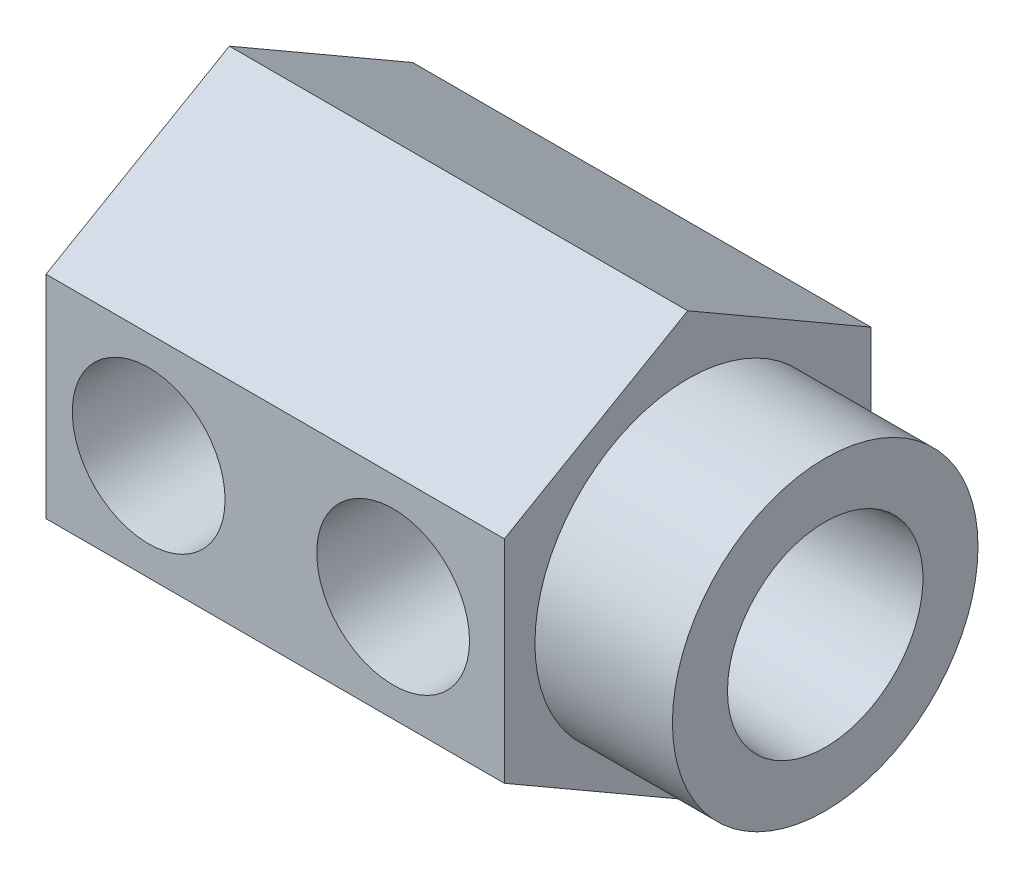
from build123d import *

# Parameters (mm, degrees)
BOSS_EXTRUDE1_DEPTH                = 23.8125
SKETCH2_R                          = 7.9375
BOSS_EXTRUDE2_DEPTH                = 7.14375
F_1_16_NPT_TAPPED_HOLE2_AT_2_COUNT = 2
F_1_16_NPT_TAPPED_HOLE2_AT_2_PITCH = 12.7
F_21_0_159_DIAMETER_HOLE1_D        = 4.0386
F_21_0_159_DIAMETER_HOLE1_DEPTH    = 25.4
F_21_0_159_DIAMETER_HOLE1_TIP      = 1.213317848
F_3_16_0_1875_DIAMETER_HOLE1_D     = 4.7625
F_3_16_0_1875_DIAMETER_HOLE1_DEPTH = 22.86
F_3_16_0_1875_DIAMETER_HOLE1_TIP   = 1.430799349


with BuildPart() as part:
    # Sketch1 → Boss-Extrude1 (new body)
    with BuildSketch(Plane(origin=(0, 0, 0), x_dir=(0, 0, -1), z_dir=(1, 0, 0))):
        Polygon((9.525, -5.499261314), (9.525, 5.499261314), (0, 10.998522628), (-9.525, 5.499261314), (-9.525, -5.499261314), (0, -10.998522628), align=None)
    extrude(amount=BOSS_EXTRUDE1_DEPTH)

    # Sketch2 → Boss-Extrude2 (add)
    with BuildSketch(Plane(origin=(23.8125, 0, 0), x_dir=(0, 0, -1), z_dir=(1, 0, 0))):
        Circle(SKETCH2_R)
    extrude(amount=BOSS_EXTRUDE2_DEPTH)

    # Sketch3 → Cut-Revolve1 (revolve, cut)
    with BuildSketch(Plane(origin=(0, 0, 0), x_dir=(1, 0, 0), z_dir=(0, 1, 0)), mode=Mode.PRIVATE) as cut_revolve1_sk:
        Polygon((30.95625, 0), (30.95625, 5.07746), (23.97125, 4.711391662), (23.97125, 3.4163), (14.31925, 3.4163), (14.31925, 0), align=None)
    revolve(cut_revolve1_sk.sketch.rotate(Axis((-5.616376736, 0, 0), (1, 0, 0)), 180), axis=Axis((-5.616376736, 0, 0), (1, 0, 0)), mode=Mode.SUBTRACT)

    # Sketch4 → 1_16 NPT Tapped Hole1 (revolve, cut)
    with BuildSketch(Plane(origin=(5.334, 0, -9.525), x_dir=(0, 1, 0), z_dir=(1, 0, 0))):
        Polygon((0, 0), (0, 13.436705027), (3.0734, 11.59002), (3.0734, 6.88594), (3.762575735, 6.88594), (3.96875, 0), align=None)
    revolve(axis=Axis((5.334, 0, -15.875), (0, 0, 1)), mode=Mode.SUBTRACT)

    # Sketch6 → 1_16 NPT Tapped Hole2 (revolve, cut)
    with BuildSketch(Plane(origin=(5.334, 0, 9.525), x_dir=(0, -1, 0), z_dir=(1, 0, 0))):
        Polygon((0, 0), (0, 17.721685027), (3.0734, 15.875), (3.0734, 6.88594), (3.762575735, 6.88594), (3.96875, 0), align=None)
    f_1_16_npt_tapped_hole2 = revolve(axis=Axis((5.334, 0, 15.875), (0, 0, -1)), mode=Mode.SUBTRACT)

    # 1_16 NPT Tapped Hole2 at 2: 1_16 NPT Tapped Hole2 ×2
    with Locations(*[(i * F_1_16_NPT_TAPPED_HOLE2_AT_2_PITCH, 0, 0) for i in range(1, F_1_16_NPT_TAPPED_HOLE2_AT_2_COUNT)]):
        add(f_1_16_npt_tapped_hole2, mode=Mode.SUBTRACT)

    # 21 _0.159_ Diameter Hole1
    with Locations(Plane(origin=(30.95625, 0, 0), x_dir=(0, 0, -1), z_dir=(1, 0, 0))):
        with Locations((0, 0)):
            Hole(F_21_0_159_DIAMETER_HOLE1_D / 2, depth=F_21_0_159_DIAMETER_HOLE1_DEPTH)
            with Locations((0, 0, -(F_21_0_159_DIAMETER_HOLE1_DEPTH + F_21_0_159_DIAMETER_HOLE1_TIP / 2))):  # 118° drill point
                Cone(0, F_21_0_159_DIAMETER_HOLE1_D / 2, F_21_0_159_DIAMETER_HOLE1_TIP, mode=Mode.SUBTRACT)

    # 3_16 _0.1875_ Diameter Hole1
    with Locations(Plane(origin=(30.95625, 0, 0), x_dir=(0, 0, -1), z_dir=(1, 0, 0))):
        with Locations((0, 0)):
            Hole(F_3_16_0_1875_DIAMETER_HOLE1_D / 2, depth=F_3_16_0_1875_DIAMETER_HOLE1_DEPTH)
            with Locations((0, 0, -(F_3_16_0_1875_DIAMETER_HOLE1_DEPTH + F_3_16_0_1875_DIAMETER_HOLE1_TIP / 2))):  # 118° drill point
                Cone(0, F_3_16_0_1875_DIAMETER_HOLE1_D / 2, F_3_16_0_1875_DIAMETER_HOLE1_TIP, mode=Mode.SUBTRACT)


solid = part.part
